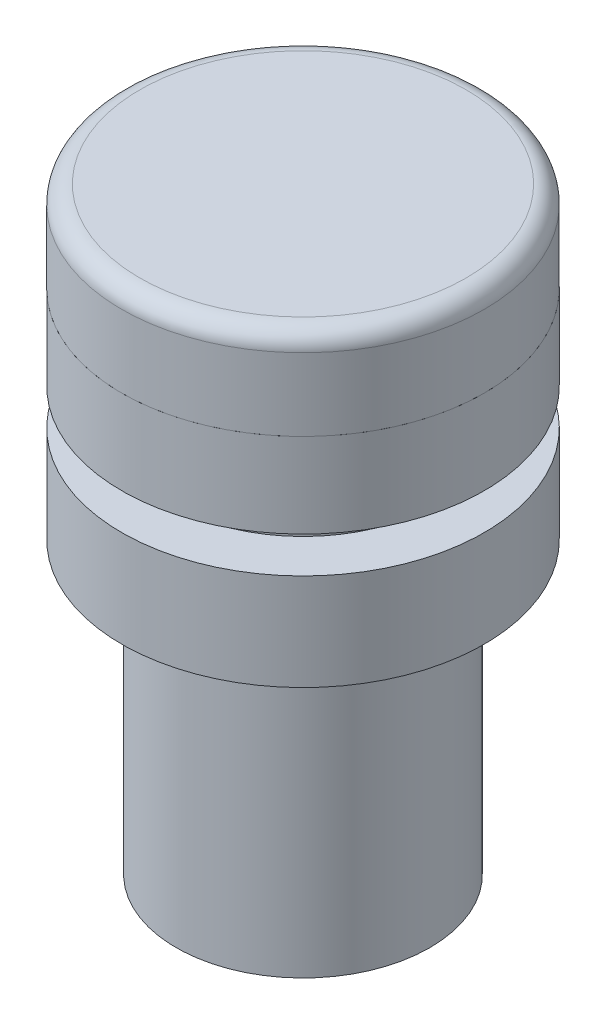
ISO-10303-21;
HEADER;
FILE_DESCRIPTION(('STEP AP214'),'2;1');
FILE_NAME('part.step','',(''),(''),'','','');
FILE_SCHEMA(('AUTOMOTIVE_DESIGN { 1 0 10303 214 1 1 1 1 }'));
ENDSEC;
DATA;
#1=APPLICATION_CONTEXT('core data for automotive mechanical design processes');
#2=APPLICATION_PROTOCOL_DEFINITION('international standard','automotive_design',2000,#1);
#3=PRODUCT_CONTEXT('',#1,'mechanical');
#4=PRODUCT('Part','Part','',(#3));
#5=PRODUCT_RELATED_PRODUCT_CATEGORY('part','',(#4));
#6=PRODUCT_DEFINITION_FORMATION('','',#4);
#7=PRODUCT_DEFINITION_CONTEXT('part definition',#1,'design');
#8=PRODUCT_DEFINITION('design','',#6,#7);
#9=PRODUCT_DEFINITION_SHAPE('','',#8);
#10=(LENGTH_UNIT() NAMED_UNIT(*) SI_UNIT(.MILLI.,.METRE.));
#11=(NAMED_UNIT(*) PLANE_ANGLE_UNIT() SI_UNIT($,.RADIAN.));
#12=(NAMED_UNIT(*) SI_UNIT($,.STERADIAN.) SOLID_ANGLE_UNIT());
#13=UNCERTAINTY_MEASURE_WITH_UNIT(LENGTH_MEASURE(1.E-05),#10,'distance_accuracy_value','');
#14=(GEOMETRIC_REPRESENTATION_CONTEXT(3) GLOBAL_UNCERTAINTY_ASSIGNED_CONTEXT((#13)) GLOBAL_UNIT_ASSIGNED_CONTEXT((#10,
#11,#12)) REPRESENTATION_CONTEXT('',''));
#15=CARTESIAN_POINT('',(0.,0.,0.));
#16=DIRECTION('',(0.,0.,1.));
#17=DIRECTION('',(1.,0.,0.));
#18=AXIS2_PLACEMENT_3D('',#15,#16,#17);
#19=CARTESIAN_POINT('',(0.,11.75,0.));
#20=DIRECTION('',(0.,-1.,0.));
#21=DIRECTION('',(1.,0.,0.));
#22=AXIS2_PLACEMENT_3D('',#19,#20,#21);
#23=TOROIDAL_SURFACE('',#22,12.25,0.749999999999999);
#24=CARTESIAN_POINT('',(0.,12.5,0.));
#25=DIRECTION('',(0.,-1.,0.));
#26=DIRECTION('',(1.,0.,0.));
#27=AXIS2_PLACEMENT_3D('',#24,#25,#26);
#28=CIRCLE('',#27,12.25);
#29=CARTESIAN_POINT('',(12.25,12.5,0.));
#30=VERTEX_POINT('',#29);
#31=EDGE_CURVE('E11',#30,#30,#28,.T.);
#32=ORIENTED_EDGE('',*,*,#31,.F.);
#33=EDGE_LOOP('',(#32));
#34=FACE_BOUND('',#33,.T.);
#35=CARTESIAN_POINT('',(0.,11.75,0.));
#36=DIRECTION('',(0.,-1.,0.));
#37=DIRECTION('',(1.,0.,0.));
#38=AXIS2_PLACEMENT_3D('',#35,#36,#37);
#39=CIRCLE('',#38,13.);
#40=CARTESIAN_POINT('',(13.,11.75,0.));
#41=VERTEX_POINT('',#40);
#42=EDGE_CURVE('E68',#41,#41,#39,.T.);
#43=ORIENTED_EDGE('',*,*,#42,.T.);
#44=EDGE_LOOP('',(#43));
#45=FACE_BOUND('',#44,.T.);
#46=ADVANCED_FACE('F46',(#34,#45),#23,.F.);
#47=CARTESIAN_POINT('',(0.,12.5,0.));
#48=DIRECTION('',(0.,1.,0.));
#49=DIRECTION('',(-1.,0.,0.));
#50=AXIS2_PLACEMENT_3D('',#47,#48,#49);
#51=PLANE('',#50);
#52=ORIENTED_EDGE('',*,*,#31,.T.);
#53=EDGE_LOOP('',(#52));
#54=FACE_BOUND('',#53,.T.);
#55=ADVANCED_FACE('F98',(#54),#51,.F.);
#56=CARTESIAN_POINT('',(0.,14.5,0.));
#57=DIRECTION('',(0.,-1.,0.));
#58=DIRECTION('',(1.,0.,0.));
#59=AXIS2_PLACEMENT_3D('',#56,#57,#58);
#60=PLANE('',#59);
#61=CARTESIAN_POINT('',(0.,14.5,0.));
#62=DIRECTION('',(0.,-1.,0.));
#63=DIRECTION('',(1.,0.,0.));
#64=AXIS2_PLACEMENT_3D('',#61,#62,#63);
#65=CIRCLE('',#64,13.5);
#66=CARTESIAN_POINT('',(13.5,14.5,0.));
#67=VERTEX_POINT('',#66);
#68=EDGE_CURVE('E52',#67,#67,#65,.T.);
#69=ORIENTED_EDGE('',*,*,#68,.F.);
#70=EDGE_LOOP('',(#69));
#71=FACE_BOUND('',#70,.T.);
#72=ADVANCED_FACE('F93',(#71),#60,.F.);
#73=CARTESIAN_POINT('',(0.,13.,0.));
#74=DIRECTION('',(0.,-1.,0.));
#75=DIRECTION('',(1.,0.,0.));
#76=AXIS2_PLACEMENT_3D('',#73,#74,#75);
#77=TOROIDAL_SURFACE('',#76,13.5,1.5);
#78=CARTESIAN_POINT('',(0.,13.,0.));
#79=DIRECTION('',(0.,-1.,0.));
#80=DIRECTION('',(1.,0.,0.));
#81=AXIS2_PLACEMENT_3D('',#78,#79,#80);
#82=CIRCLE('',#81,15.);
#83=CARTESIAN_POINT('',(15.,13.,0.));
#84=VERTEX_POINT('',#83);
#85=EDGE_CURVE('E56',#84,#84,#82,.T.);
#86=ORIENTED_EDGE('',*,*,#85,.F.);
#87=EDGE_LOOP('',(#86));
#88=FACE_BOUND('',#87,.T.);
#89=ORIENTED_EDGE('',*,*,#68,.T.);
#90=EDGE_LOOP('',(#89));
#91=FACE_BOUND('',#90,.T.);
#92=ADVANCED_FACE('F88',(#88,#91),#77,.T.);
#93=CARTESIAN_POINT('',(0.,12.5,0.));
#94=DIRECTION('',(0.,-1.,0.));
#95=DIRECTION('',(1.,0.,0.));
#96=AXIS2_PLACEMENT_3D('',#93,#94,#95);
#97=CYLINDRICAL_SURFACE('',#96,15.);
#98=CARTESIAN_POINT('',(0.,6.99999999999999,0.));
#99=DIRECTION('',(0.,-1.,0.));
#100=DIRECTION('',(1.,0.,0.));
#101=AXIS2_PLACEMENT_3D('',#98,#99,#100);
#102=CIRCLE('',#101,15.);
#103=CARTESIAN_POINT('',(15.,6.99999999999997,0.));
#104=VERTEX_POINT('',#103);
#105=EDGE_CURVE('E60',#104,#104,#102,.T.);
#106=ORIENTED_EDGE('',*,*,#105,.F.);
#107=EDGE_LOOP('',(#106));
#108=FACE_BOUND('',#107,.T.);
#109=ORIENTED_EDGE('',*,*,#85,.T.);
#110=EDGE_LOOP('',(#109));
#111=FACE_BOUND('',#110,.T.);
#112=ADVANCED_FACE('F82',(#108,#111),#97,.T.);
#113=CARTESIAN_POINT('',(-15.,7.,0.));
#114=DIRECTION('',(0.,1.,0.));
#115=DIRECTION('',(-1.,0.,0.));
#116=AXIS2_PLACEMENT_3D('',#113,#114,#115);
#117=PLANE('',#116);
#118=CARTESIAN_POINT('',(0.,6.99999999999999,0.));
#119=DIRECTION('',(0.,-1.,0.));
#120=DIRECTION('',(1.,0.,0.));
#121=AXIS2_PLACEMENT_3D('',#118,#119,#120);
#122=CIRCLE('',#121,13.);
#123=CARTESIAN_POINT('',(13.,6.99999999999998,0.));
#124=VERTEX_POINT('',#123);
#125=EDGE_CURVE('E65',#124,#124,#122,.T.);
#126=ORIENTED_EDGE('',*,*,#125,.F.);
#127=EDGE_LOOP('',(#126));
#128=FACE_BOUND('',#127,.T.);
#129=ORIENTED_EDGE('',*,*,#105,.T.);
#130=EDGE_LOOP('',(#129));
#131=FACE_BOUND('',#130,.T.);
#132=ADVANCED_FACE('F76',(#128,#131),#117,.F.);
#133=CARTESIAN_POINT('',(0.,12.5,0.));
#134=DIRECTION('',(0.,-1.,0.));
#135=DIRECTION('',(1.,0.,0.));
#136=AXIS2_PLACEMENT_3D('',#133,#134,#135);
#137=CYLINDRICAL_SURFACE('',#136,13.);
#138=ORIENTED_EDGE('',*,*,#42,.F.);
#139=EDGE_LOOP('',(#138));
#140=FACE_BOUND('',#139,.T.);
#141=ORIENTED_EDGE('',*,*,#125,.T.);
#142=EDGE_LOOP('',(#141));
#143=FACE_BOUND('',#142,.T.);
#144=ADVANCED_FACE('F73',(#140,#143),#137,.F.);
#145=CLOSED_SHELL('',(#46,#55,#72,#92,#112,#132,#144));
#146=MANIFOLD_SOLID_BREP('B2',#145);
#147=CARTESIAN_POINT('',(0.,12.5,0.));
#148=DIRECTION('',(0.,1.,0.));
#149=DIRECTION('',(-1.,0.,0.));
#150=AXIS2_PLACEMENT_3D('',#147,#148,#149);
#151=PLANE('',#150);
#152=CARTESIAN_POINT('',(0.,12.5,0.));
#153=DIRECTION('',(0.,1.,0.));
#154=DIRECTION('',(-1.,0.,0.));
#155=AXIS2_PLACEMENT_3D('',#152,#153,#154);
#156=CIRCLE('',#155,12.25);
#157=CARTESIAN_POINT('',(-12.25,12.5,0.));
#158=VERTEX_POINT('',#157);
#159=EDGE_CURVE('E45',#158,#158,#156,.T.);
#160=ORIENTED_EDGE('',*,*,#159,.T.);
#161=EDGE_LOOP('',(#160));
#162=FACE_BOUND('',#161,.T.);
#163=ADVANCED_FACE('F157',(#162),#151,.T.);
#164=CARTESIAN_POINT('',(0.,11.75,0.));
#165=DIRECTION('',(0.,1.,0.));
#166=DIRECTION('',(-1.,0.,0.));
#167=AXIS2_PLACEMENT_3D('',#164,#165,#166);
#168=TOROIDAL_SURFACE('',#167,12.25,0.75);
#169=CARTESIAN_POINT('',(0.,11.75,0.));
#170=DIRECTION('',(0.,1.,0.));
#171=DIRECTION('',(-1.,0.,0.));
#172=AXIS2_PLACEMENT_3D('',#169,#170,#171);
#173=CIRCLE('',#172,13.);
#174=CARTESIAN_POINT('',(-13.,11.75,0.));
#175=VERTEX_POINT('',#174);
#176=EDGE_CURVE('E163',#175,#175,#173,.T.);
#177=ORIENTED_EDGE('',*,*,#176,.T.);
#178=EDGE_LOOP('',(#177));
#179=FACE_BOUND('',#178,.T.);
#180=ORIENTED_EDGE('',*,*,#159,.F.);
#181=EDGE_LOOP('',(#180));
#182=FACE_BOUND('',#181,.T.);
#183=ADVANCED_FACE('F183',(#179,#182),#168,.T.);
#184=CARTESIAN_POINT('',(0.,0.,0.));
#185=DIRECTION('',(0.,1.,0.));
#186=DIRECTION('',(-1.,0.,0.));
#187=AXIS2_PLACEMENT_3D('',#184,#185,#186);
#188=CYLINDRICAL_SURFACE('',#187,13.);
#189=CARTESIAN_POINT('',(0.,7.1,0.));
#190=DIRECTION('',(0.,1.,0.));
#191=DIRECTION('',(-1.,0.,0.));
#192=AXIS2_PLACEMENT_3D('',#189,#190,#191);
#193=CIRCLE('',#192,13.);
#194=CARTESIAN_POINT('',(-13.,7.1,0.));
#195=VERTEX_POINT('',#194);
#196=EDGE_CURVE('E167',#195,#195,#193,.T.);
#197=ORIENTED_EDGE('',*,*,#196,.T.);
#198=EDGE_LOOP('',(#197));
#199=FACE_BOUND('',#198,.T.);
#200=ORIENTED_EDGE('',*,*,#176,.F.);
#201=EDGE_LOOP('',(#200));
#202=FACE_BOUND('',#201,.T.);
#203=ADVANCED_FACE('F174',(#199,#202),#188,.T.);
#204=CARTESIAN_POINT('',(0.,7.1,0.));
#205=DIRECTION('',(0.,-1.,0.));
#206=DIRECTION('',(1.,0.,0.));
#207=AXIS2_PLACEMENT_3D('',#204,#205,#206);
#208=PLANE('',#207);
#209=ORIENTED_EDGE('',*,*,#196,.F.);
#210=EDGE_LOOP('',(#209));
#211=FACE_BOUND('',#210,.T.);
#212=ADVANCED_FACE('F177',(#211),#208,.T.);
#213=CLOSED_SHELL('',(#163,#183,#203,#212));
#214=MANIFOLD_SOLID_BREP('B6',#213);
#215=CARTESIAN_POINT('',(-15.,7.,0.));
#216=DIRECTION('',(0.,1.,0.));
#217=DIRECTION('',(-1.,0.,0.));
#218=AXIS2_PLACEMENT_3D('',#215,#216,#217);
#219=PLANE('',#218);
#220=CARTESIAN_POINT('',(0.,7.,0.));
#221=DIRECTION('',(0.,1.,0.));
#222=DIRECTION('',(-1.,0.,0.));
#223=AXIS2_PLACEMENT_3D('',#220,#221,#222);
#224=CIRCLE('',#223,15.);
#225=CARTESIAN_POINT('',(-15.,7.,0.));
#226=VERTEX_POINT('',#225);
#227=EDGE_CURVE('E241',#226,#226,#224,.T.);
#228=ORIENTED_EDGE('',*,*,#227,.T.);
#229=EDGE_LOOP('',(#228));
#230=FACE_BOUND('',#229,.T.);
#231=ADVANCED_FACE('F213',(#230),#219,.T.);
#232=CARTESIAN_POINT('',(0.,-35.,0.));
#233=DIRECTION('',(0.,-1.,0.));
#234=DIRECTION('',(1.,0.,0.));
#235=AXIS2_PLACEMENT_3D('',#232,#233,#234);
#236=PLANE('',#235);
#237=CARTESIAN_POINT('',(0.,-35.,0.));
#238=DIRECTION('',(0.,1.,0.));
#239=DIRECTION('',(-1.,0.,0.));
#240=AXIS2_PLACEMENT_3D('',#237,#238,#239);
#241=CIRCLE('',#240,10.5);
#242=CARTESIAN_POINT('',(-10.5,-35.,0.));
#243=VERTEX_POINT('',#242);
#244=EDGE_CURVE('E156',#243,#243,#241,.T.);
#245=ORIENTED_EDGE('',*,*,#244,.F.);
#246=EDGE_LOOP('',(#245));
#247=FACE_BOUND('',#246,.T.);
#248=ADVANCED_FACE('F258',(#247),#236,.T.);
#249=CARTESIAN_POINT('',(0.,0.,0.));
#250=DIRECTION('',(0.,1.,0.));
#251=DIRECTION('',(-1.,0.,0.));
#252=AXIS2_PLACEMENT_3D('',#249,#250,#251);
#253=CYLINDRICAL_SURFACE('',#252,10.5);
#254=ORIENTED_EDGE('',*,*,#244,.T.);
#255=EDGE_LOOP('',(#254));
#256=FACE_BOUND('',#255,.T.);
#257=CARTESIAN_POINT('',(0.,-11.,0.));
#258=DIRECTION('',(0.,1.,0.));
#259=DIRECTION('',(-1.,0.,0.));
#260=AXIS2_PLACEMENT_3D('',#257,#258,#259);
#261=CIRCLE('',#260,10.5);
#262=CARTESIAN_POINT('',(-10.5,-11.,0.));
#263=VERTEX_POINT('',#262);
#264=EDGE_CURVE('E219',#263,#263,#261,.T.);
#265=ORIENTED_EDGE('',*,*,#264,.F.);
#266=EDGE_LOOP('',(#265));
#267=FACE_BOUND('',#266,.T.);
#268=ADVANCED_FACE('F262',(#256,#267),#253,.T.);
#269=CARTESIAN_POINT('',(-10.5,-11.,0.));
#270=DIRECTION('',(0.,-1.,0.));
#271=DIRECTION('',(1.,0.,0.));
#272=AXIS2_PLACEMENT_3D('',#269,#270,#271);
#273=PLANE('',#272);
#274=ORIENTED_EDGE('',*,*,#264,.T.);
#275=EDGE_LOOP('',(#274));
#276=FACE_BOUND('',#275,.T.);
#277=CARTESIAN_POINT('',(0.,-11.,0.));
#278=DIRECTION('',(0.,1.,0.));
#279=DIRECTION('',(-1.,0.,0.));
#280=AXIS2_PLACEMENT_3D('',#277,#278,#279);
#281=CIRCLE('',#280,15.);
#282=CARTESIAN_POINT('',(-15.,-11.,0.));
#283=VERTEX_POINT('',#282);
#284=EDGE_CURVE('E223',#283,#283,#281,.T.);
#285=ORIENTED_EDGE('',*,*,#284,.F.);
#286=EDGE_LOOP('',(#285));
#287=FACE_BOUND('',#286,.T.);
#288=ADVANCED_FACE('F267',(#276,#287),#273,.T.);
#289=CARTESIAN_POINT('',(0.,0.,0.));
#290=DIRECTION('',(0.,1.,0.));
#291=DIRECTION('',(-1.,0.,0.));
#292=AXIS2_PLACEMENT_3D('',#289,#290,#291);
#293=CYLINDRICAL_SURFACE('',#292,15.);
#294=ORIENTED_EDGE('',*,*,#284,.T.);
#295=EDGE_LOOP('',(#294));
#296=FACE_BOUND('',#295,.T.);
#297=CARTESIAN_POINT('',(0.,-3.,0.));
#298=DIRECTION('',(0.,1.,0.));
#299=DIRECTION('',(-1.,0.,0.));
#300=AXIS2_PLACEMENT_3D('',#297,#298,#299);
#301=CIRCLE('',#300,15.);
#302=CARTESIAN_POINT('',(-15.,-3.,0.));
#303=VERTEX_POINT('',#302);
#304=EDGE_CURVE('E227',#303,#303,#301,.T.);
#305=ORIENTED_EDGE('',*,*,#304,.F.);
#306=EDGE_LOOP('',(#305));
#307=FACE_BOUND('',#306,.T.);
#308=ADVANCED_FACE('F272',(#296,#307),#293,.T.);
#309=CARTESIAN_POINT('',(-15.,-3.,0.));
#310=DIRECTION('',(0.,1.,0.));
#311=DIRECTION('',(-1.,0.,0.));
#312=AXIS2_PLACEMENT_3D('',#309,#310,#311);
#313=PLANE('',#312);
#314=ORIENTED_EDGE('',*,*,#304,.T.);
#315=EDGE_LOOP('',(#314));
#316=FACE_BOUND('',#315,.T.);
#317=CARTESIAN_POINT('',(0.,-3.,0.));
#318=DIRECTION('',(0.,1.,0.));
#319=DIRECTION('',(-1.,0.,0.));
#320=AXIS2_PLACEMENT_3D('',#317,#318,#319);
#321=CIRCLE('',#320,11.);
#322=CARTESIAN_POINT('',(-11.,-3.,0.));
#323=VERTEX_POINT('',#322);
#324=EDGE_CURVE('E232',#323,#323,#321,.T.);
#325=ORIENTED_EDGE('',*,*,#324,.F.);
#326=EDGE_LOOP('',(#325));
#327=FACE_BOUND('',#326,.T.);
#328=ADVANCED_FACE('F275',(#316,#327),#313,.T.);
#329=CARTESIAN_POINT('',(0.,0.,0.));
#330=DIRECTION('',(0.,1.,0.));
#331=DIRECTION('',(-1.,0.,0.));
#332=AXIS2_PLACEMENT_3D('',#329,#330,#331);
#333=CYLINDRICAL_SURFACE('',#332,11.);
#334=ORIENTED_EDGE('',*,*,#324,.T.);
#335=EDGE_LOOP('',(#334));
#336=FACE_BOUND('',#335,.T.);
#337=CARTESIAN_POINT('',(0.,0.,0.));
#338=DIRECTION('',(0.,1.,0.));
#339=DIRECTION('',(-1.,0.,0.));
#340=AXIS2_PLACEMENT_3D('',#337,#338,#339);
#341=CIRCLE('',#340,11.);
#342=CARTESIAN_POINT('',(-11.,0.,0.));
#343=VERTEX_POINT('',#342);
#344=EDGE_CURVE('E235',#343,#343,#341,.T.);
#345=ORIENTED_EDGE('',*,*,#344,.F.);
#346=EDGE_LOOP('',(#345));
#347=FACE_BOUND('',#346,.T.);
#348=ADVANCED_FACE('F254',(#336,#347),#333,.T.);
#349=CARTESIAN_POINT('',(-11.,0.,0.));
#350=DIRECTION('',(0.,-1.,0.));
#351=DIRECTION('',(1.,0.,0.));
#352=AXIS2_PLACEMENT_3D('',#349,#350,#351);
#353=PLANE('',#352);
#354=ORIENTED_EDGE('',*,*,#344,.T.);
#355=EDGE_LOOP('',(#354));
#356=FACE_BOUND('',#355,.T.);
#357=CARTESIAN_POINT('',(0.,0.,0.));
#358=DIRECTION('',(0.,1.,0.));
#359=DIRECTION('',(-1.,0.,0.));
#360=AXIS2_PLACEMENT_3D('',#357,#358,#359);
#361=CIRCLE('',#360,15.);
#362=CARTESIAN_POINT('',(-15.,0.,0.));
#363=VERTEX_POINT('',#362);
#364=EDGE_CURVE('E238',#363,#363,#361,.T.);
#365=ORIENTED_EDGE('',*,*,#364,.F.);
#366=EDGE_LOOP('',(#365));
#367=FACE_BOUND('',#366,.T.);
#368=ADVANCED_FACE('F248',(#356,#367),#353,.T.);
#369=CARTESIAN_POINT('',(0.,0.,0.));
#370=DIRECTION('',(0.,1.,0.));
#371=DIRECTION('',(-1.,0.,0.));
#372=AXIS2_PLACEMENT_3D('',#369,#370,#371);
#373=CYLINDRICAL_SURFACE('',#372,15.);
#374=ORIENTED_EDGE('',*,*,#364,.T.);
#375=EDGE_LOOP('',(#374));
#376=FACE_BOUND('',#375,.T.);
#377=ORIENTED_EDGE('',*,*,#227,.F.);
#378=EDGE_LOOP('',(#377));
#379=FACE_BOUND('',#378,.T.);
#380=ADVANCED_FACE('F246',(#376,#379),#373,.T.);
#381=CLOSED_SHELL('',(#231,#248,#268,#288,#308,#328,#348,#368,#380));
#382=MANIFOLD_SOLID_BREP('B40',#381);
#383=ADVANCED_BREP_SHAPE_REPRESENTATION('',(#18,#146,#214,#382),#14);
#384=SHAPE_DEFINITION_REPRESENTATION(#9,#383);
ENDSEC;
END-ISO-10303-21;
